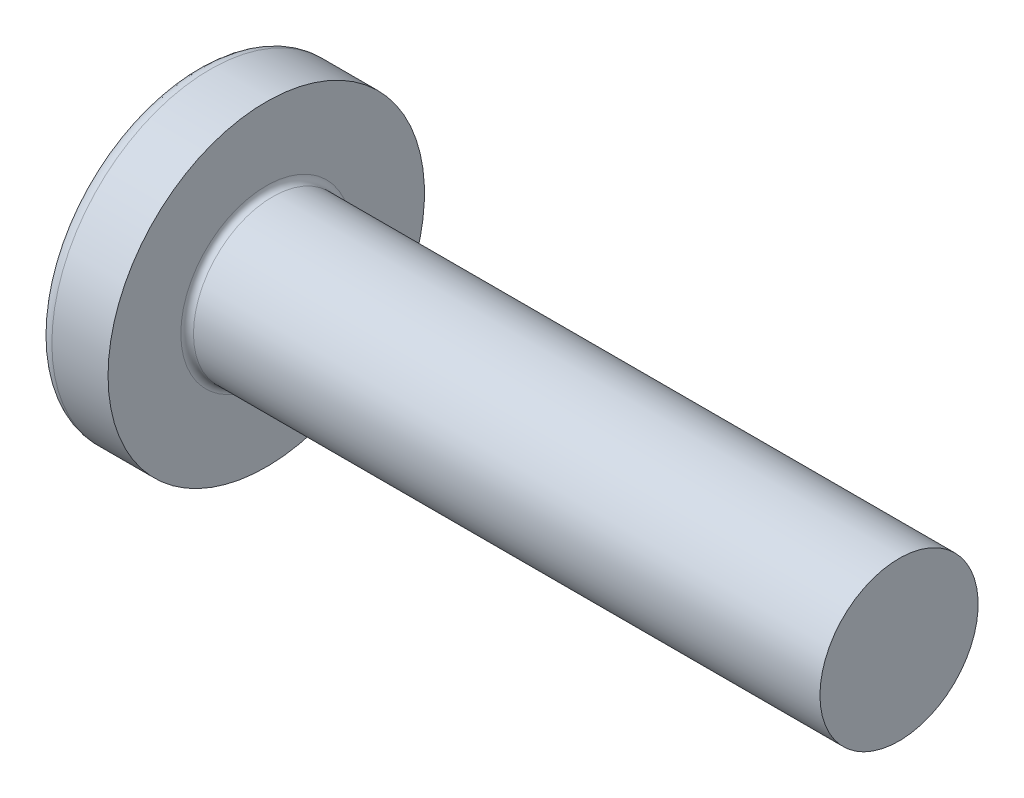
ISO-10303-21;
HEADER;
FILE_DESCRIPTION(('STEP AP214'),'2;1');
FILE_NAME('part.step','',(''),(''),'','','');
FILE_SCHEMA(('AUTOMOTIVE_DESIGN { 1 0 10303 214 1 1 1 1 }'));
ENDSEC;
DATA;
#1=APPLICATION_CONTEXT('core data for automotive mechanical design processes');
#2=APPLICATION_PROTOCOL_DEFINITION('international standard','automotive_design',2000,#1);
#3=PRODUCT_CONTEXT('',#1,'mechanical');
#4=PRODUCT('Part','Part','',(#3));
#5=PRODUCT_RELATED_PRODUCT_CATEGORY('part','',(#4));
#6=PRODUCT_DEFINITION_FORMATION('','',#4);
#7=PRODUCT_DEFINITION_CONTEXT('part definition',#1,'design');
#8=PRODUCT_DEFINITION('design','',#6,#7);
#9=PRODUCT_DEFINITION_SHAPE('','',#8);
#10=(LENGTH_UNIT() NAMED_UNIT(*) SI_UNIT(.MILLI.,.METRE.));
#11=(NAMED_UNIT(*) PLANE_ANGLE_UNIT() SI_UNIT($,.RADIAN.));
#12=(NAMED_UNIT(*) SI_UNIT($,.STERADIAN.) SOLID_ANGLE_UNIT());
#13=UNCERTAINTY_MEASURE_WITH_UNIT(LENGTH_MEASURE(1.E-05),#10,'distance_accuracy_value','');
#14=(GEOMETRIC_REPRESENTATION_CONTEXT(3) GLOBAL_UNCERTAINTY_ASSIGNED_CONTEXT((#13)) GLOBAL_UNIT_ASSIGNED_CONTEXT((#10,
#11,#12)) REPRESENTATION_CONTEXT('',''));
#15=CARTESIAN_POINT('',(0.,0.,0.));
#16=DIRECTION('',(0.,0.,1.));
#17=DIRECTION('',(1.,0.,0.));
#18=AXIS2_PLACEMENT_3D('',#15,#16,#17);
#19=CARTESIAN_POINT('',(16.,0.,0.));
#20=DIRECTION('',(-1.,0.,0.));
#21=DIRECTION('',(0.,1.,0.));
#22=AXIS2_PLACEMENT_3D('',#19,#20,#21);
#23=SPHERICAL_SURFACE('',#22,16.);
#24=CARTESIAN_POINT('',(3.23189799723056,0.,0.));
#25=DIRECTION('',(-1.,0.,0.));
#26=DIRECTION('',(0.,0.,1.));
#27=AXIS2_PLACEMENT_3D('',#24,#25,#26);
#28=CIRCLE('',#27,9.64238410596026);
#29=CARTESIAN_POINT('',(3.23189799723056,0.,9.64238410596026));
#30=VERTEX_POINT('',#29);
#31=EDGE_CURVE('E627',#30,#30,#28,.T.);
#32=ORIENTED_EDGE('',*,*,#31,.T.);
#33=EDGE_LOOP('',(#32));
#34=FACE_BOUND('',#33,.T.);
#35=CARTESIAN_POINT('',(0.168594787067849,0.,0.));
#36=DIRECTION('',(1.,0.,0.));
#37=DIRECTION('',(0.,0.,-1.));
#38=AXIS2_PLACEMENT_3D('',#35,#36,#37);
#39=CIRCLE('',#38,2.31659426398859);
#40=CARTESIAN_POINT('',(0.168594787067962,-1.07999999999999,-2.0494411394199));
#41=VERTEX_POINT('',#40);
#42=CARTESIAN_POINT('',(0.168594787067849,-2.04944113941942,-1.08));
#43=VERTEX_POINT('',#42);
#44=EDGE_CURVE('E579',#41,#43,#39,.F.);
#45=ORIENTED_EDGE('',*,*,#44,.F.);
#46=CARTESIAN_POINT('',(16.,-1.08,0.));
#47=DIRECTION('',(0.,1.,0.));
#48=DIRECTION('',(0.,0.,1.));
#49=AXIS2_PLACEMENT_3D('',#46,#47,#48);
#50=CIRCLE('',#49,15.9635083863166);
#51=CARTESIAN_POINT('',(0.712603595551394,-1.07999999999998,-4.5966412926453));
#52=VERTEX_POINT('',#51);
#53=EDGE_CURVE('E598',#52,#41,#50,.T.);
#54=ORIENTED_EDGE('',*,*,#53,.F.);
#55=CARTESIAN_POINT('',(14.8123836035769,0.,2.39501587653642));
#56=DIRECTION('',(-0.444251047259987,0.,0.895902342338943));
#57=DIRECTION('',(0.895902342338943,0.,0.444251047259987));
#58=AXIS2_PLACEMENT_3D('',#55,#56,#57);
#59=CIRCLE('',#58,15.7750900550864);
#60=CARTESIAN_POINT('',(0.712603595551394,1.08000000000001,-4.5966412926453));
#61=VERTEX_POINT('',#60);
#62=EDGE_CURVE('E61',#61,#52,#59,.T.);
#63=ORIENTED_EDGE('',*,*,#62,.F.);
#64=CARTESIAN_POINT('',(16.,1.08,0.));
#65=DIRECTION('',(0.,-1.,0.));
#66=DIRECTION('',(0.,0.,-1.));
#67=AXIS2_PLACEMENT_3D('',#64,#65,#66);
#68=CIRCLE('',#67,15.9635083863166);
#69=CARTESIAN_POINT('',(0.168594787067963,1.08000000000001,-2.04944113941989));
#70=VERTEX_POINT('',#69);
#71=EDGE_CURVE('E493',#70,#61,#68,.T.);
#72=ORIENTED_EDGE('',*,*,#71,.F.);
#73=CARTESIAN_POINT('',(0.168594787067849,2.04944113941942,-1.08));
#74=VERTEX_POINT('',#73);
#75=EDGE_CURVE('E583',#74,#70,#39,.F.);
#76=ORIENTED_EDGE('',*,*,#75,.F.);
#77=CARTESIAN_POINT('',(16.,0.,-1.08));
#78=DIRECTION('',(0.,0.,1.));
#79=DIRECTION('',(1.,0.,0.));
#80=AXIS2_PLACEMENT_3D('',#77,#78,#79);
#81=CIRCLE('',#80,15.9635083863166);
#82=CARTESIAN_POINT('',(0.712603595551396,4.5966412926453,-1.08));
#83=VERTEX_POINT('',#82);
#84=EDGE_CURVE('E638',#83,#74,#81,.T.);
#85=ORIENTED_EDGE('',*,*,#84,.F.);
#86=CARTESIAN_POINT('',(14.8123836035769,-2.39501587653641,0.));
#87=DIRECTION('',(-0.444251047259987,-0.895902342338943,0.));
#88=DIRECTION('',(0.895902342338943,-0.444251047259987,0.));
#89=AXIS2_PLACEMENT_3D('',#86,#87,#88);
#90=CIRCLE('',#89,15.7750900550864);
#91=CARTESIAN_POINT('',(0.712603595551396,4.5966412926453,1.08));
#92=VERTEX_POINT('',#91);
#93=EDGE_CURVE('E635',#92,#83,#90,.T.);
#94=ORIENTED_EDGE('',*,*,#93,.F.);
#95=CARTESIAN_POINT('',(16.,0.,1.08));
#96=DIRECTION('',(0.,0.,-1.));
#97=DIRECTION('',(-1.,0.,0.));
#98=AXIS2_PLACEMENT_3D('',#95,#96,#97);
#99=CIRCLE('',#98,15.9635083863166);
#100=CARTESIAN_POINT('',(0.168594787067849,2.04944113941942,1.08));
#101=VERTEX_POINT('',#100);
#102=EDGE_CURVE('E77',#101,#92,#99,.T.);
#103=ORIENTED_EDGE('',*,*,#102,.F.);
#104=CARTESIAN_POINT('',(0.168594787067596,1.07999999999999,2.04944113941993));
#105=VERTEX_POINT('',#104);
#106=EDGE_CURVE('E576',#105,#101,#39,.F.);
#107=ORIENTED_EDGE('',*,*,#106,.F.);
#108=CARTESIAN_POINT('',(0.712603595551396,1.07999999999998,4.5966412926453));
#109=VERTEX_POINT('',#108);
#110=EDGE_CURVE('E596',#109,#105,#68,.T.);
#111=ORIENTED_EDGE('',*,*,#110,.F.);
#112=CARTESIAN_POINT('',(14.8123836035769,0.,-2.39501587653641));
#113=DIRECTION('',(-0.444251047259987,0.,-0.895902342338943));
#114=DIRECTION('',(-0.895902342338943,0.,0.444251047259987));
#115=AXIS2_PLACEMENT_3D('',#112,#113,#114);
#116=CIRCLE('',#115,15.7750900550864);
#117=CARTESIAN_POINT('',(0.712603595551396,-1.08000000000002,4.59664129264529));
#118=VERTEX_POINT('',#117);
#119=EDGE_CURVE('E644',#118,#109,#116,.T.);
#120=ORIENTED_EDGE('',*,*,#119,.F.);
#121=CARTESIAN_POINT('',(0.168594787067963,-1.08000000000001,2.0494411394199));
#122=VERTEX_POINT('',#121);
#123=EDGE_CURVE('E537',#122,#118,#50,.T.);
#124=ORIENTED_EDGE('',*,*,#123,.F.);
#125=CARTESIAN_POINT('',(0.168594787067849,-2.04944113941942,1.08));
#126=VERTEX_POINT('',#125);
#127=EDGE_CURVE('E580',#126,#122,#39,.F.);
#128=ORIENTED_EDGE('',*,*,#127,.F.);
#129=CARTESIAN_POINT('',(0.712603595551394,-4.5966412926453,1.08));
#130=VERTEX_POINT('',#129);
#131=EDGE_CURVE('E640',#130,#126,#99,.T.);
#132=ORIENTED_EDGE('',*,*,#131,.F.);
#133=CARTESIAN_POINT('',(14.8123836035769,2.39501587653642,0.));
#134=DIRECTION('',(-0.444251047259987,0.895902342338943,0.));
#135=DIRECTION('',(-0.895902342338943,-0.444251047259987,0.));
#136=AXIS2_PLACEMENT_3D('',#133,#134,#135);
#137=CIRCLE('',#136,15.7750900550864);
#138=CARTESIAN_POINT('',(0.712603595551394,-4.5966412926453,-1.08));
#139=VERTEX_POINT('',#138);
#140=EDGE_CURVE('E643',#139,#130,#137,.T.);
#141=ORIENTED_EDGE('',*,*,#140,.F.);
#142=EDGE_CURVE('E637',#43,#139,#81,.T.);
#143=ORIENTED_EDGE('',*,*,#142,.F.);
#144=EDGE_LOOP('',(#45,#54,#63,#72,#76,#85,#94,#103,#107,#111,#120,#124,#128,#132,#141,#143));
#145=FACE_BOUND('',#144,.T.);
#146=ADVANCED_FACE('F51',(#34,#145),#23,.T.);
#147=CARTESIAN_POINT('',(0.,-4.94999999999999,1.08));
#148=DIRECTION('',(0.,0.,-1.));
#149=DIRECTION('',(-1.,0.,0.));
#150=AXIS2_PLACEMENT_3D('',#147,#148,#149);
#151=PLANE('',#150);
#152=ORIENTED_EDGE('',*,*,#131,.T.);
#153=CARTESIAN_POINT('',(0.0728418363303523,-2.05700662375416,1.08));
#154=CARTESIAN_POINT('',(0.794525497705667,-1.99998209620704,1.08));
#155=CARTESIAN_POINT('',(1.51617389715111,-1.94249850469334,1.08));
#156=CARTESIAN_POINT('',(2.95936074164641,-1.82619641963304,1.08));
#157=CARTESIAN_POINT('',(3.68089918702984,-1.76737793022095,1.08));
#158=CARTESIAN_POINT('',(4.61701813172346,-1.68992292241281,1.08));
#159=CARTESIAN_POINT('',(4.83166467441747,-1.67208487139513,1.08));
#160=CARTESIAN_POINT('',(5.26094349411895,-1.63623560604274,1.08));
#161=CARTESIAN_POINT('',(5.47557577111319,-1.61822439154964,1.08));
#162=CARTESIAN_POINT('',(5.6902,-1.60011757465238,1.08));
#163=B_SPLINE_CURVE_WITH_KNOTS('',3,(#153,#154,#155,#156,#157,#158,#159,#160,#161,#162),
.UNSPECIFIED.,.F.,.F.,(4,2,2,2,4),(0.,2.171800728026,4.34359473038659,4.98975409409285,
5.63591404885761),.UNSPECIFIED.);
#164=CARTESIAN_POINT('',(5.69,-1.60013444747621,1.08));
#165=VERTEX_POINT('',#164);
#166=EDGE_CURVE('E584',#126,#165,#163,.T.);
#167=ORIENTED_EDGE('',*,*,#166,.T.);
#168=DIRECTION('',(0.,-1.,0.));
#169=VECTOR('',#168,1.);
#170=CARTESIAN_POINT('',(5.69,-2.1285,1.08));
#171=LINE('',#170,#169);
#172=CARTESIAN_POINT('',(5.69,-2.1285,1.08));
#173=VERTEX_POINT('',#172);
#174=EDGE_CURVE('E530',#165,#173,#171,.T.);
#175=ORIENTED_EDGE('',*,*,#174,.T.);
#176=DIRECTION('',(0.895902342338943,0.444251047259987,0.));
#177=VECTOR('',#176,1.);
#178=CARTESIAN_POINT('',(0.,-4.95,1.08));
#179=LINE('',#178,#177);
#180=EDGE_CURVE('E613',#130,#173,#179,.T.);
#181=ORIENTED_EDGE('',*,*,#180,.F.);
#182=EDGE_LOOP('',(#152,#167,#175,#181));
#183=FACE_BOUND('',#182,.T.);
#184=ADVANCED_FACE('F185',(#183),#151,.T.);
#185=CARTESIAN_POINT('',(5.69,2.1285,1.08));
#186=VERTEX_POINT('',#185);
#187=CARTESIAN_POINT('',(5.69,1.60013444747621,1.08));
#188=VERTEX_POINT('',#187);
#189=EDGE_CURVE('E526',#186,#188,#171,.T.);
#190=ORIENTED_EDGE('',*,*,#189,.T.);
#191=CARTESIAN_POINT('',(5.6902,1.60011757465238,1.08));
#192=CARTESIAN_POINT('',(5.09079066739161,1.65066713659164,1.08));
#193=CARTESIAN_POINT('',(4.4913223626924,1.70051091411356,1.08));
#194=CARTESIAN_POINT('',(3.29229250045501,1.79904942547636,1.08));
#195=CARTESIAN_POINT('',(2.69273094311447,1.84774416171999,1.08));
#196=CARTESIAN_POINT('',(1.75643946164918,1.92309066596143,1.08));
#197=CARTESIAN_POINT('',(1.41973386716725,1.95004585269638,1.08));
#198=CARTESIAN_POINT('',(0.746302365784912,2.00370630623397,1.08));
#199=CARTESIAN_POINT('',(0.409576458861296,2.03041157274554,1.08));
#200=CARTESIAN_POINT('',(0.0728418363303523,2.05700662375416,1.08));
#201=B_SPLINE_CURVE_WITH_KNOTS('',3,(#191,#192,#193,#194,#195,#196,#197,#198,#199,#200),
.UNSPECIFIED.,.F.,.F.,(4,2,2,2,4),(0.,1.80460992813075,3.60921608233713,4.62256450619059,
5.63591411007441),.UNSPECIFIED.);
#202=EDGE_CURVE('E577',#188,#101,#201,.T.);
#203=ORIENTED_EDGE('',*,*,#202,.T.);
#204=ORIENTED_EDGE('',*,*,#102,.T.);
#205=DIRECTION('',(0.895902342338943,-0.444251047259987,0.));
#206=VECTOR('',#205,1.);
#207=CARTESIAN_POINT('',(0.,4.95,1.08));
#208=LINE('',#207,#206);
#209=EDGE_CURVE('E542',#92,#186,#208,.T.);
#210=ORIENTED_EDGE('',*,*,#209,.T.);
#211=EDGE_LOOP('',(#190,#203,#204,#210));
#212=FACE_BOUND('',#211,.T.);
#213=ADVANCED_FACE('F190',(#212),#151,.T.);
#214=CARTESIAN_POINT('',(0.,4.95,-1.08));
#215=DIRECTION('',(0.,0.,1.));
#216=DIRECTION('',(1.,0.,0.));
#217=AXIS2_PLACEMENT_3D('',#214,#215,#216);
#218=PLANE('',#217);
#219=DIRECTION('',(0.,1.,0.));
#220=VECTOR('',#219,1.);
#221=CARTESIAN_POINT('',(5.69,-2.1285,-1.08));
#222=LINE('',#221,#220);
#223=CARTESIAN_POINT('',(5.69,-2.1285,-1.08));
#224=VERTEX_POINT('',#223);
#225=CARTESIAN_POINT('',(5.69,-1.60013444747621,-1.08));
#226=VERTEX_POINT('',#225);
#227=EDGE_CURVE('E456',#224,#226,#222,.T.);
#228=ORIENTED_EDGE('',*,*,#227,.T.);
#229=CARTESIAN_POINT('',(5.6902,-1.60011757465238,-1.08));
#230=CARTESIAN_POINT('',(5.09079066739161,-1.65066713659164,-1.08));
#231=CARTESIAN_POINT('',(4.4913223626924,-1.70051091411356,-1.08));
#232=CARTESIAN_POINT('',(3.29229250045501,-1.79904942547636,-1.08));
#233=CARTESIAN_POINT('',(2.69273094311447,-1.84774416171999,-1.08));
#234=CARTESIAN_POINT('',(1.75643946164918,-1.92309066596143,-1.08));
#235=CARTESIAN_POINT('',(1.41973386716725,-1.95004585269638,-1.08));
#236=CARTESIAN_POINT('',(0.746302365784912,-2.00370630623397,-1.08));
#237=CARTESIAN_POINT('',(0.409576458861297,-2.03041157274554,-1.08));
#238=CARTESIAN_POINT('',(0.0728418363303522,-2.05700662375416,-1.08));
#239=B_SPLINE_CURVE_WITH_KNOTS('',3,(#229,#230,#231,#232,#233,#234,#235,#236,#237,#238),
.UNSPECIFIED.,.F.,.F.,(4,2,2,2,4),(0.,1.80460992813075,3.60921608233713,4.62256450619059,
5.63591411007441),.UNSPECIFIED.);
#240=EDGE_CURVE('E364',#226,#43,#239,.T.);
#241=ORIENTED_EDGE('',*,*,#240,.T.);
#242=ORIENTED_EDGE('',*,*,#142,.T.);
#243=DIRECTION('',(0.895902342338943,0.444251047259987,0.));
#244=VECTOR('',#243,1.);
#245=CARTESIAN_POINT('',(0.,-4.95,-1.08));
#246=LINE('',#245,#244);
#247=EDGE_CURVE('E611',#139,#224,#246,.T.);
#248=ORIENTED_EDGE('',*,*,#247,.T.);
#249=EDGE_LOOP('',(#228,#241,#242,#248));
#250=FACE_BOUND('',#249,.T.);
#251=ADVANCED_FACE('F463',(#250),#218,.T.);
#252=ORIENTED_EDGE('',*,*,#84,.T.);
#253=CARTESIAN_POINT('',(0.0728418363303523,2.05700662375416,-1.08));
#254=CARTESIAN_POINT('',(0.794525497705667,1.99998209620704,-1.08));
#255=CARTESIAN_POINT('',(1.51617389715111,1.94249850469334,-1.08));
#256=CARTESIAN_POINT('',(2.95936074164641,1.82619641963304,-1.08));
#257=CARTESIAN_POINT('',(3.68089918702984,1.76737793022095,-1.08));
#258=CARTESIAN_POINT('',(4.61701813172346,1.68992292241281,-1.08));
#259=CARTESIAN_POINT('',(4.83166467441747,1.67208487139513,-1.08));
#260=CARTESIAN_POINT('',(5.26094349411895,1.63623560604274,-1.08));
#261=CARTESIAN_POINT('',(5.47557577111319,1.61822439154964,-1.08));
#262=CARTESIAN_POINT('',(5.6902,1.60011757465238,-1.08));
#263=B_SPLINE_CURVE_WITH_KNOTS('',3,(#253,#254,#255,#256,#257,#258,#259,#260,#261,#262),
.UNSPECIFIED.,.F.,.F.,(4,2,2,2,4),(0.,2.171800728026,4.34359473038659,4.98975409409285,
5.63591404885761),.UNSPECIFIED.);
#264=CARTESIAN_POINT('',(5.69,1.60013444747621,-1.08));
#265=VERTEX_POINT('',#264);
#266=EDGE_CURVE('E588',#74,#265,#263,.T.);
#267=ORIENTED_EDGE('',*,*,#266,.T.);
#268=CARTESIAN_POINT('',(5.69,2.1285,-1.08));
#269=VERTEX_POINT('',#268);
#270=EDGE_CURVE('E516',#265,#269,#222,.T.);
#271=ORIENTED_EDGE('',*,*,#270,.T.);
#272=DIRECTION('',(0.895902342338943,-0.444251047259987,0.));
#273=VECTOR('',#272,1.);
#274=CARTESIAN_POINT('',(0.,4.95,-1.08));
#275=LINE('',#274,#273);
#276=EDGE_CURVE('E608',#83,#269,#275,.T.);
#277=ORIENTED_EDGE('',*,*,#276,.F.);
#278=EDGE_LOOP('',(#252,#267,#271,#277));
#279=FACE_BOUND('',#278,.T.);
#280=ADVANCED_FACE('F222',(#279),#218,.T.);
#281=CARTESIAN_POINT('',(5.69,2.1285,1.08));
#282=DIRECTION('',(-1.,0.,0.));
#283=DIRECTION('',(0.,0.,1.));
#284=AXIS2_PLACEMENT_3D('',#281,#282,#283);
#285=PLANE('',#284);
#286=ORIENTED_EDGE('',*,*,#174,.F.);
#287=CARTESIAN_POINT('',(5.69,0.,0.));
#288=DIRECTION('',(-1.,0.,0.));
#289=DIRECTION('',(0.,0.,1.));
#290=AXIS2_PLACEMENT_3D('',#287,#288,#289);
#291=CIRCLE('',#290,1.9305);
#292=EDGE_CURVE('E545',#226,#165,#291,.T.);
#293=ORIENTED_EDGE('',*,*,#292,.F.);
#294=ORIENTED_EDGE('',*,*,#227,.F.);
#295=DIRECTION('',(0.,0.,-1.));
#296=VECTOR('',#295,1.);
#297=CARTESIAN_POINT('',(5.69,-2.1285,1.08));
#298=LINE('',#297,#296);
#299=EDGE_CURVE('E538',#173,#224,#298,.T.);
#300=ORIENTED_EDGE('',*,*,#299,.F.);
#301=EDGE_LOOP('',(#286,#293,#294,#300));
#302=FACE_BOUND('',#301,.T.);
#303=ADVANCED_FACE('F217',(#302),#285,.T.);
#304=DIRECTION('',(0.,0.,-1.));
#305=VECTOR('',#304,1.);
#306=CARTESIAN_POINT('',(5.69,-1.07999999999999,-2.1285));
#307=LINE('',#306,#305);
#308=CARTESIAN_POINT('',(5.69,-1.07999999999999,-1.60013444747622));
#309=VERTEX_POINT('',#308);
#310=CARTESIAN_POINT('',(5.69,-1.07999999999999,-2.1285));
#311=VERTEX_POINT('',#310);
#312=EDGE_CURVE('E518',#309,#311,#307,.T.);
#313=ORIENTED_EDGE('',*,*,#312,.F.);
#314=CARTESIAN_POINT('',(5.69,1.08000000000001,-1.60013444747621));
#315=VERTEX_POINT('',#314);
#316=EDGE_CURVE('E510',#315,#309,#291,.T.);
#317=ORIENTED_EDGE('',*,*,#316,.F.);
#318=DIRECTION('',(0.,0.,1.));
#319=VECTOR('',#318,1.);
#320=CARTESIAN_POINT('',(5.69,1.08000000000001,-2.1285));
#321=LINE('',#320,#319);
#322=CARTESIAN_POINT('',(5.69,1.08000000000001,-2.1285));
#323=VERTEX_POINT('',#322);
#324=EDGE_CURVE('E403',#323,#315,#321,.T.);
#325=ORIENTED_EDGE('',*,*,#324,.F.);
#326=DIRECTION('',(0.,1.,0.));
#327=VECTOR('',#326,1.);
#328=CARTESIAN_POINT('',(5.69,-1.07999999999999,-2.1285));
#329=LINE('',#328,#327);
#330=EDGE_CURVE('E502',#311,#323,#329,.T.);
#331=ORIENTED_EDGE('',*,*,#330,.F.);
#332=EDGE_LOOP('',(#313,#317,#325,#331));
#333=FACE_BOUND('',#332,.T.);
#334=ADVANCED_FACE('F221',(#333),#285,.T.);
#335=ORIENTED_EDGE('',*,*,#270,.F.);
#336=EDGE_CURVE('E561',#188,#265,#291,.T.);
#337=ORIENTED_EDGE('',*,*,#336,.F.);
#338=ORIENTED_EDGE('',*,*,#189,.F.);
#339=DIRECTION('',(0.,0.,1.));
#340=VECTOR('',#339,1.);
#341=CARTESIAN_POINT('',(5.69,2.1285,1.08));
#342=LINE('',#341,#340);
#343=EDGE_CURVE('E529',#269,#186,#342,.T.);
#344=ORIENTED_EDGE('',*,*,#343,.F.);
#345=EDGE_LOOP('',(#335,#337,#338,#344));
#346=FACE_BOUND('',#345,.T.);
#347=ADVANCED_FACE('F682',(#346),#285,.T.);
#348=CARTESIAN_POINT('',(5.69,1.07999999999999,1.60013444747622));
#349=VERTEX_POINT('',#348);
#350=CARTESIAN_POINT('',(5.69,1.07999999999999,2.1285));
#351=VERTEX_POINT('',#350);
#352=EDGE_CURVE('E296',#349,#351,#321,.T.);
#353=ORIENTED_EDGE('',*,*,#352,.F.);
#354=CARTESIAN_POINT('',(5.69,-1.08000000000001,1.60013444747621));
#355=VERTEX_POINT('',#354);
#356=EDGE_CURVE('E553',#355,#349,#291,.T.);
#357=ORIENTED_EDGE('',*,*,#356,.F.);
#358=CARTESIAN_POINT('',(5.69,-1.08000000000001,2.1285));
#359=VERTEX_POINT('',#358);
#360=EDGE_CURVE('E55',#359,#355,#307,.T.);
#361=ORIENTED_EDGE('',*,*,#360,.F.);
#362=DIRECTION('',(0.,-1.,0.));
#363=VECTOR('',#362,1.);
#364=CARTESIAN_POINT('',(5.69,-1.08000000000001,2.1285));
#365=LINE('',#364,#363);
#366=EDGE_CURVE('E420',#351,#359,#365,.T.);
#367=ORIENTED_EDGE('',*,*,#366,.F.);
#368=EDGE_LOOP('',(#353,#357,#361,#367));
#369=FACE_BOUND('',#368,.T.);
#370=ADVANCED_FACE('F224',(#369),#285,.T.);
#371=CARTESIAN_POINT('',(0.,-1.07999999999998,-4.95));
#372=DIRECTION('',(0.,1.,0.));
#373=DIRECTION('',(-1.,0.,0.));
#374=AXIS2_PLACEMENT_3D('',#371,#372,#373);
#375=PLANE('',#374);
#376=ORIENTED_EDGE('',*,*,#53,.T.);
#377=CARTESIAN_POINT('',(0.0728418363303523,-1.07999999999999,-2.05700662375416));
#378=CARTESIAN_POINT('',(0.794525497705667,-1.07999999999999,-1.99998209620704));
#379=CARTESIAN_POINT('',(1.51617389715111,-1.07999999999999,-1.94249850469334));
#380=CARTESIAN_POINT('',(2.95936074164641,-1.07999999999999,-1.82619641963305));
#381=CARTESIAN_POINT('',(3.68089918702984,-1.07999999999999,-1.76737793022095));
#382=CARTESIAN_POINT('',(4.61701813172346,-1.07999999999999,-1.68992292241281));
#383=CARTESIAN_POINT('',(4.83166467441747,-1.07999999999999,-1.67208487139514));
#384=CARTESIAN_POINT('',(5.26094349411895,-1.07999999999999,-1.63623560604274));
#385=CARTESIAN_POINT('',(5.47557577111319,-1.07999999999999,-1.61822439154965));
#386=CARTESIAN_POINT('',(5.6902,-1.07999999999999,-1.60011757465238));
#387=B_SPLINE_CURVE_WITH_KNOTS('',3,(#377,#378,#379,#380,#381,#382,#383,#384,#385,#386),
.UNSPECIFIED.,.F.,.F.,(4,2,2,2,4),(0.,2.171800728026,4.34359473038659,4.98975409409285,
5.63591404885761),.UNSPECIFIED.);
#388=EDGE_CURVE('E363',#41,#309,#387,.T.);
#389=ORIENTED_EDGE('',*,*,#388,.T.);
#390=ORIENTED_EDGE('',*,*,#312,.T.);
#391=DIRECTION('',(0.895902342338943,0.,0.444251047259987));
#392=VECTOR('',#391,1.);
#393=CARTESIAN_POINT('',(0.,-1.07999999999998,-4.95));
#394=LINE('',#393,#392);
#395=EDGE_CURVE('E492',#52,#311,#394,.T.);
#396=ORIENTED_EDGE('',*,*,#395,.F.);
#397=EDGE_LOOP('',(#376,#389,#390,#396));
#398=FACE_BOUND('',#397,.T.);
#399=ADVANCED_FACE('F365',(#398),#375,.T.);
#400=CARTESIAN_POINT('',(0.,1.07999999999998,4.95));
#401=DIRECTION('',(0.,-1.,0.));
#402=DIRECTION('',(1.,0.,0.));
#403=AXIS2_PLACEMENT_3D('',#400,#401,#402);
#404=PLANE('',#403);
#405=ORIENTED_EDGE('',*,*,#324,.T.);
#406=CARTESIAN_POINT('',(5.6902,1.08,-1.60011757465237));
#407=CARTESIAN_POINT('',(5.09079066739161,1.08000000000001,-1.65066713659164));
#408=CARTESIAN_POINT('',(4.4913223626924,1.08000000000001,-1.70051091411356));
#409=CARTESIAN_POINT('',(3.29229250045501,1.08000000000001,-1.79904942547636));
#410=CARTESIAN_POINT('',(2.69273094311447,1.08000000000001,-1.84774416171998));
#411=CARTESIAN_POINT('',(1.75643946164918,1.08000000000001,-1.92309066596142));
#412=CARTESIAN_POINT('',(1.41973386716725,1.08000000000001,-1.95004585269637));
#413=CARTESIAN_POINT('',(0.746302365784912,1.08000000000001,-2.00370630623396));
#414=CARTESIAN_POINT('',(0.409576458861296,1.08000000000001,-2.03041157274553));
#415=CARTESIAN_POINT('',(0.0728418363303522,1.08000000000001,-2.05700662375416));
#416=B_SPLINE_CURVE_WITH_KNOTS('',3,(#406,#407,#408,#409,#410,#411,#412,#413,#414,#415),
.UNSPECIFIED.,.F.,.F.,(4,2,2,2,4),(0.,1.80460992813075,3.60921608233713,4.62256450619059,
5.63591411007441),.UNSPECIFIED.);
#417=EDGE_CURVE('E587',#315,#70,#416,.T.);
#418=ORIENTED_EDGE('',*,*,#417,.T.);
#419=ORIENTED_EDGE('',*,*,#71,.T.);
#420=DIRECTION('',(0.895902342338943,0.,0.444251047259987));
#421=VECTOR('',#420,1.);
#422=CARTESIAN_POINT('',(0.,1.08000000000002,-4.95));
#423=LINE('',#422,#421);
#424=EDGE_CURVE('E487',#61,#323,#423,.T.);
#425=ORIENTED_EDGE('',*,*,#424,.T.);
#426=EDGE_LOOP('',(#405,#418,#419,#425));
#427=FACE_BOUND('',#426,.T.);
#428=ADVANCED_FACE('F307',(#427),#404,.T.);
#429=ORIENTED_EDGE('',*,*,#360,.T.);
#430=CARTESIAN_POINT('',(5.6902,-1.08000000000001,1.60011757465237));
#431=CARTESIAN_POINT('',(5.09079066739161,-1.08000000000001,1.65066713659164));
#432=CARTESIAN_POINT('',(4.4913223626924,-1.08000000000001,1.70051091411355));
#433=CARTESIAN_POINT('',(3.29229250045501,-1.08000000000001,1.79904942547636));
#434=CARTESIAN_POINT('',(2.69273094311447,-1.08000000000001,1.84774416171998));
#435=CARTESIAN_POINT('',(1.75643946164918,-1.08000000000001,1.92309066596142));
#436=CARTESIAN_POINT('',(1.41973386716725,-1.08000000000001,1.95004585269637));
#437=CARTESIAN_POINT('',(0.746302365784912,-1.08000000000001,2.00370630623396));
#438=CARTESIAN_POINT('',(0.409576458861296,-1.08000000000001,2.03041157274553));
#439=CARTESIAN_POINT('',(0.0728418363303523,-1.08000000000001,2.05700662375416));
#440=B_SPLINE_CURVE_WITH_KNOTS('',3,(#430,#431,#432,#433,#434,#435,#436,#437,#438,#439),
.UNSPECIFIED.,.F.,.F.,(4,2,2,2,4),(0.,1.80460992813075,3.60921608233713,4.62256450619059,
5.63591411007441),.UNSPECIFIED.);
#441=EDGE_CURVE('E582',#355,#122,#440,.T.);
#442=ORIENTED_EDGE('',*,*,#441,.T.);
#443=ORIENTED_EDGE('',*,*,#123,.T.);
#444=DIRECTION('',(0.895902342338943,0.,-0.444251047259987));
#445=VECTOR('',#444,1.);
#446=CARTESIAN_POINT('',(0.,-1.08000000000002,4.95));
#447=LINE('',#446,#445);
#448=EDGE_CURVE('E488',#118,#359,#447,.T.);
#449=ORIENTED_EDGE('',*,*,#448,.T.);
#450=EDGE_LOOP('',(#429,#442,#443,#449));
#451=FACE_BOUND('',#450,.T.);
#452=ADVANCED_FACE('F369',(#451),#375,.T.);
#453=ORIENTED_EDGE('',*,*,#110,.T.);
#454=CARTESIAN_POINT('',(0.0728418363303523,1.07999999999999,2.05700662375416));
#455=CARTESIAN_POINT('',(0.794525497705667,1.07999999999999,1.99998209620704));
#456=CARTESIAN_POINT('',(1.51617389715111,1.07999999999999,1.94249850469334));
#457=CARTESIAN_POINT('',(2.95936074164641,1.07999999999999,1.82619641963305));
#458=CARTESIAN_POINT('',(3.68089918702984,1.07999999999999,1.76737793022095));
#459=CARTESIAN_POINT('',(4.61701813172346,1.07999999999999,1.68992292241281));
#460=CARTESIAN_POINT('',(4.83166467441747,1.07999999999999,1.67208487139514));
#461=CARTESIAN_POINT('',(5.26094349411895,1.07999999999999,1.63623560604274));
#462=CARTESIAN_POINT('',(5.47557577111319,1.07999999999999,1.61822439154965));
#463=CARTESIAN_POINT('',(5.6902,1.07999999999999,1.60011757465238));
#464=B_SPLINE_CURVE_WITH_KNOTS('',3,(#454,#455,#456,#457,#458,#459,#460,#461,#462,#463),
.UNSPECIFIED.,.F.,.F.,(4,2,2,2,4),(0.,2.171800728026,4.34359473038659,4.98975409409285,
5.63591404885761),.UNSPECIFIED.);
#465=EDGE_CURVE('E12',#105,#349,#464,.T.);
#466=ORIENTED_EDGE('',*,*,#465,.T.);
#467=ORIENTED_EDGE('',*,*,#352,.T.);
#468=DIRECTION('',(0.895902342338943,0.,-0.444251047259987));
#469=VECTOR('',#468,1.);
#470=CARTESIAN_POINT('',(0.,1.07999999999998,4.95));
#471=LINE('',#470,#469);
#472=EDGE_CURVE('E484',#109,#351,#471,.T.);
#473=ORIENTED_EDGE('',*,*,#472,.F.);
#474=EDGE_LOOP('',(#453,#466,#467,#473));
#475=FACE_BOUND('',#474,.T.);
#476=ADVANCED_FACE('F200',(#475),#404,.T.);
#477=CARTESIAN_POINT('',(3.95010373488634,0.,0.));
#478=DIRECTION('',(-1.,0.,0.));
#479=DIRECTION('',(0.,0.,1.));
#480=AXIS2_PLACEMENT_3D('',#477,#478,#479);
#481=TOROIDAL_SURFACE('',#480,9.1,0.899999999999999);
#482=ORIENTED_EDGE('',*,*,#31,.F.);
#483=EDGE_LOOP('',(#482));
#484=FACE_BOUND('',#483,.T.);
#485=CARTESIAN_POINT('',(3.95010373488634,0.,0.));
#486=DIRECTION('',(-1.,0.,0.));
#487=DIRECTION('',(0.,0.,1.));
#488=AXIS2_PLACEMENT_3D('',#485,#486,#487);
#489=CIRCLE('',#488,10.);
#490=CARTESIAN_POINT('',(3.95010373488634,0.,10.));
#491=VERTEX_POINT('',#490);
#492=EDGE_CURVE('E624',#491,#491,#489,.T.);
#493=ORIENTED_EDGE('',*,*,#492,.T.);
#494=EDGE_LOOP('',(#493));
#495=FACE_BOUND('',#494,.T.);
#496=ADVANCED_FACE('F196',(#484,#495),#481,.T.);
#497=CARTESIAN_POINT('',(0.,0.,0.));
#498=DIRECTION('',(-1.,0.,0.));
#499=DIRECTION('',(0.,0.,1.));
#500=AXIS2_PLACEMENT_3D('',#497,#498,#499);
#501=CYLINDRICAL_SURFACE('',#500,10.);
#502=ORIENTED_EDGE('',*,*,#492,.F.);
#503=EDGE_LOOP('',(#502));
#504=FACE_BOUND('',#503,.T.);
#505=CARTESIAN_POINT('',(7.5,0.,0.));
#506=DIRECTION('',(-1.,0.,0.));
#507=DIRECTION('',(0.,0.,1.));
#508=AXIS2_PLACEMENT_3D('',#505,#506,#507);
#509=CIRCLE('',#508,10.);
#510=CARTESIAN_POINT('',(7.5,0.,10.));
#511=VERTEX_POINT('',#510);
#512=EDGE_CURVE('E621',#511,#511,#509,.T.);
#513=ORIENTED_EDGE('',*,*,#512,.T.);
#514=EDGE_LOOP('',(#513));
#515=FACE_BOUND('',#514,.T.);
#516=ADVANCED_FACE('F199',(#504,#515),#501,.T.);
#517=CARTESIAN_POINT('',(7.5,4.99999999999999,0.));
#518=DIRECTION('',(-1.,0.,0.));
#519=DIRECTION('',(0.,0.,1.));
#520=AXIS2_PLACEMENT_3D('',#517,#518,#519);
#521=PLANE('',#520);
#522=CARTESIAN_POINT('',(7.5,0.,0.));
#523=DIRECTION('',(-1.,0.,0.));
#524=DIRECTION('',(0.,0.,1.));
#525=AXIS2_PLACEMENT_3D('',#522,#523,#524);
#526=CIRCLE('',#525,5.4);
#527=CARTESIAN_POINT('',(7.5,0.,5.4));
#528=VERTEX_POINT('',#527);
#529=EDGE_CURVE('E629',#528,#528,#526,.T.);
#530=ORIENTED_EDGE('',*,*,#529,.T.);
#531=EDGE_LOOP('',(#530));
#532=FACE_BOUND('',#531,.T.);
#533=ORIENTED_EDGE('',*,*,#512,.F.);
#534=EDGE_LOOP('',(#533));
#535=FACE_BOUND('',#534,.T.);
#536=ADVANCED_FACE('F204',(#532,#535),#521,.F.);
#537=CARTESIAN_POINT('',(0.,0.,0.));
#538=DIRECTION('',(-1.,0.,0.));
#539=DIRECTION('',(0.,0.,1.));
#540=AXIS2_PLACEMENT_3D('',#537,#538,#539);
#541=CYLINDRICAL_SURFACE('',#540,5.);
#542=CARTESIAN_POINT('',(7.9,0.,0.));
#543=DIRECTION('',(-1.,0.,0.));
#544=DIRECTION('',(0.,0.,1.));
#545=AXIS2_PLACEMENT_3D('',#542,#543,#544);
#546=CIRCLE('',#545,5.);
#547=CARTESIAN_POINT('',(7.9,0.,5.));
#548=VERTEX_POINT('',#547);
#549=EDGE_CURVE('E632',#548,#548,#546,.F.);
#550=ORIENTED_EDGE('',*,*,#549,.T.);
#551=EDGE_LOOP('',(#550));
#552=FACE_BOUND('',#551,.T.);
#553=CARTESIAN_POINT('',(47.5,0.,0.));
#554=DIRECTION('',(-1.,0.,0.));
#555=DIRECTION('',(0.,0.,1.));
#556=AXIS2_PLACEMENT_3D('',#553,#554,#555);
#557=CIRCLE('',#556,5.);
#558=CARTESIAN_POINT('',(47.5,0.,5.));
#559=VERTEX_POINT('',#558);
#560=EDGE_CURVE('E618',#559,#559,#557,.T.);
#561=ORIENTED_EDGE('',*,*,#560,.T.);
#562=EDGE_LOOP('',(#561));
#563=FACE_BOUND('',#562,.T.);
#564=ADVANCED_FACE('F208',(#552,#563),#541,.T.);
#565=CARTESIAN_POINT('',(47.5,0.,0.));
#566=DIRECTION('',(-1.,0.,0.));
#567=DIRECTION('',(0.,0.,1.));
#568=AXIS2_PLACEMENT_3D('',#565,#566,#567);
#569=PLANE('',#568);
#570=ORIENTED_EDGE('',*,*,#560,.F.);
#571=EDGE_LOOP('',(#570));
#572=FACE_BOUND('',#571,.T.);
#573=ADVANCED_FACE('F212',(#572),#569,.F.);
#574=CARTESIAN_POINT('',(7.9,0.,0.));
#575=DIRECTION('',(-1.,0.,0.));
#576=DIRECTION('',(0.,0.,1.));
#577=AXIS2_PLACEMENT_3D('',#574,#575,#576);
#578=TOROIDAL_SURFACE('',#577,5.4,0.4);
#579=ORIENTED_EDGE('',*,*,#549,.F.);
#580=EDGE_LOOP('',(#579));
#581=FACE_BOUND('',#580,.T.);
#582=ORIENTED_EDGE('',*,*,#529,.F.);
#583=EDGE_LOOP('',(#582));
#584=FACE_BOUND('',#583,.T.);
#585=ADVANCED_FACE('F53',(#581,#584),#578,.F.);
#586=CARTESIAN_POINT('',(5.69,-2.1285,-1.08));
#587=DIRECTION('',(-0.444251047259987,0.895902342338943,0.));
#588=DIRECTION('',(-0.895902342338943,-0.444251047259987,0.));
#589=AXIS2_PLACEMENT_3D('',#586,#587,#588);
#590=PLANE('',#589);
#591=ORIENTED_EDGE('',*,*,#140,.T.);
#592=ORIENTED_EDGE('',*,*,#180,.T.);
#593=ORIENTED_EDGE('',*,*,#299,.T.);
#594=ORIENTED_EDGE('',*,*,#247,.F.);
#595=EDGE_LOOP('',(#591,#592,#593,#594));
#596=FACE_BOUND('',#595,.T.);
#597=ADVANCED_FACE('F434',(#596),#590,.T.);
#598=CARTESIAN_POINT('',(5.69,2.1285,1.08));
#599=DIRECTION('',(-0.444251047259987,-0.895902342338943,0.));
#600=DIRECTION('',(0.895902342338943,-0.444251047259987,0.));
#601=AXIS2_PLACEMENT_3D('',#598,#599,#600);
#602=PLANE('',#601);
#603=ORIENTED_EDGE('',*,*,#93,.T.);
#604=ORIENTED_EDGE('',*,*,#276,.T.);
#605=ORIENTED_EDGE('',*,*,#343,.T.);
#606=ORIENTED_EDGE('',*,*,#209,.F.);
#607=EDGE_LOOP('',(#603,#604,#605,#606));
#608=FACE_BOUND('',#607,.T.);
#609=ADVANCED_FACE('F225',(#608),#602,.T.);
#610=CARTESIAN_POINT('',(5.69,1.08000000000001,-2.1285));
#611=DIRECTION('',(-0.444251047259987,0.,0.895902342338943));
#612=DIRECTION('',(-0.895902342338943,0.,-0.444251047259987));
#613=AXIS2_PLACEMENT_3D('',#610,#611,#612);
#614=PLANE('',#613);
#615=ORIENTED_EDGE('',*,*,#62,.T.);
#616=ORIENTED_EDGE('',*,*,#395,.T.);
#617=ORIENTED_EDGE('',*,*,#330,.T.);
#618=ORIENTED_EDGE('',*,*,#424,.F.);
#619=EDGE_LOOP('',(#615,#616,#617,#618));
#620=FACE_BOUND('',#619,.T.);
#621=ADVANCED_FACE('F370',(#620),#614,.T.);
#622=CARTESIAN_POINT('',(5.69,-1.08000000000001,2.1285));
#623=DIRECTION('',(-0.444251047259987,0.,-0.895902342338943));
#624=DIRECTION('',(0.895902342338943,0.,-0.444251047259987));
#625=AXIS2_PLACEMENT_3D('',#622,#623,#624);
#626=PLANE('',#625);
#627=ORIENTED_EDGE('',*,*,#119,.T.);
#628=ORIENTED_EDGE('',*,*,#472,.T.);
#629=ORIENTED_EDGE('',*,*,#366,.T.);
#630=ORIENTED_EDGE('',*,*,#448,.F.);
#631=EDGE_LOOP('',(#627,#628,#629,#630));
#632=FACE_BOUND('',#631,.T.);
#633=ADVANCED_FACE('F425',(#632),#626,.T.);
#634=CARTESIAN_POINT('',(5.69,0.,0.));
#635=DIRECTION('',(-1.,0.,0.));
#636=DIRECTION('',(0.,0.,1.));
#637=AXIS2_PLACEMENT_3D('',#634,#635,#636);
#638=CONICAL_SURFACE('',#637,1.9305,0.0698131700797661);
#639=EDGE_CURVE('E549',#309,#226,#291,.T.);
#640=ORIENTED_EDGE('',*,*,#639,.F.);
#641=ORIENTED_EDGE('',*,*,#388,.F.);
#642=ORIENTED_EDGE('',*,*,#44,.T.);
#643=ORIENTED_EDGE('',*,*,#240,.F.);
#644=EDGE_LOOP('',(#640,#641,#642,#643));
#645=FACE_BOUND('',#644,.T.);
#646=ADVANCED_FACE('F180',(#645),#638,.F.);
#647=ORIENTED_EDGE('',*,*,#75,.T.);
#648=ORIENTED_EDGE('',*,*,#417,.F.);
#649=EDGE_CURVE('E568',#265,#315,#291,.T.);
#650=ORIENTED_EDGE('',*,*,#649,.F.);
#651=ORIENTED_EDGE('',*,*,#266,.F.);
#652=EDGE_LOOP('',(#647,#648,#650,#651));
#653=FACE_BOUND('',#652,.T.);
#654=ADVANCED_FACE('F181',(#653),#638,.F.);
#655=ORIENTED_EDGE('',*,*,#127,.T.);
#656=ORIENTED_EDGE('',*,*,#441,.F.);
#657=EDGE_CURVE('E550',#165,#355,#291,.T.);
#658=ORIENTED_EDGE('',*,*,#657,.F.);
#659=ORIENTED_EDGE('',*,*,#166,.F.);
#660=EDGE_LOOP('',(#655,#656,#658,#659));
#661=FACE_BOUND('',#660,.T.);
#662=ADVANCED_FACE('F172',(#661),#638,.F.);
#663=CARTESIAN_POINT('',(6.31725747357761,0.,0.));
#664=DIRECTION('',(-1.,0.,0.));
#665=DIRECTION('',(0.,0.,1.));
#666=AXIS2_PLACEMENT_3D('',#663,#664,#665);
#667=CONICAL_SURFACE('',#666,0.,1.25663706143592);
#668=EDGE_CURVE('E69',#349,#188,#291,.T.);
#669=ORIENTED_EDGE('',*,*,#668,.T.);
#670=ORIENTED_EDGE('',*,*,#336,.T.);
#671=ORIENTED_EDGE('',*,*,#649,.T.);
#672=ORIENTED_EDGE('',*,*,#316,.T.);
#673=ORIENTED_EDGE('',*,*,#639,.T.);
#674=ORIENTED_EDGE('',*,*,#292,.T.);
#675=ORIENTED_EDGE('',*,*,#657,.T.);
#676=ORIENTED_EDGE('',*,*,#356,.T.);
#677=EDGE_LOOP('',(#669,#670,#671,#672,#673,#674,#675,#676));
#678=FACE_BOUND('',#677,.T.);
#679=CARTESIAN_POINT('',(6.31725747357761,0.,0.));
#680=VERTEX_POINT('',#679);
#681=VERTEX_LOOP('',#680);
#682=FACE_BOUND('',#681,.T.);
#683=ADVANCED_FACE('F169',(#678,#682),#667,.F.);
#684=ORIENTED_EDGE('',*,*,#668,.F.);
#685=ORIENTED_EDGE('',*,*,#465,.F.);
#686=ORIENTED_EDGE('',*,*,#106,.T.);
#687=ORIENTED_EDGE('',*,*,#202,.F.);
#688=EDGE_LOOP('',(#684,#685,#686,#687));
#689=FACE_BOUND('',#688,.T.);
#690=ADVANCED_FACE('F171',(#689),#638,.F.);
#691=CLOSED_SHELL('',(#146,#184,#213,#251,#280,#303,#334,#347,#370,#399,#428,#452,#476,#496,
#516,#536,#564,#573,#585,#597,#609,#621,#633,#646,#654,#662,#683,#690));
#692=MANIFOLD_SOLID_BREP('B2',#691);
#693=ADVANCED_BREP_SHAPE_REPRESENTATION('',(#18,#692),#14);
#694=SHAPE_DEFINITION_REPRESENTATION(#9,#693);
ENDSEC;
END-ISO-10303-21;
